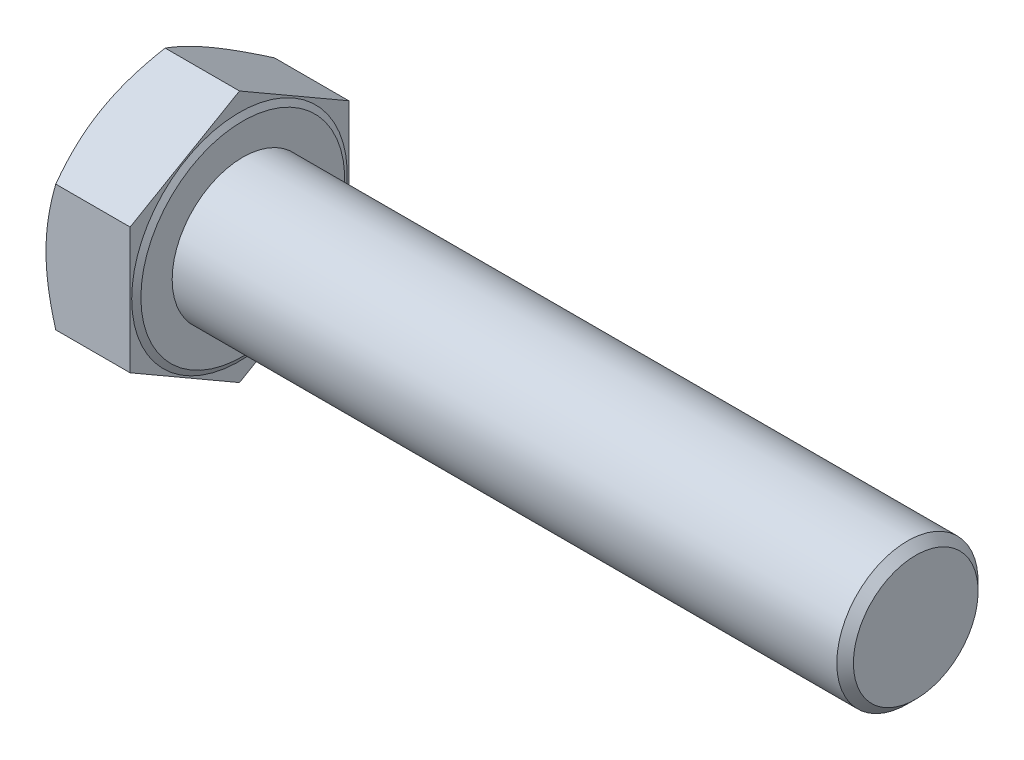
from build123d import *

# Parameters (mm, degrees)
BASEHEAD_DEPTH = 26


with BuildPart() as part:
    # HeadSke → BaseHead (new body)
    with BuildSketch(Plane(origin=(0, 0, 0), x_dir=(0, 0, -1), z_dir=(1, 0, 0))):
        Polygon((32.5, 18.763883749), (32.5, -18.763883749), (0, -37.527767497), (-32.5, -18.763883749), (-32.5, 18.763883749), (0, 37.527767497), align=None)
    extrude(amount=BASEHEAD_DEPTH)

    # BodySke → BaseBody (revolve)
    with BuildSketch(Plane.XY, mode=Mode.PRIVATE) as basebody_sk:
        Polygon((0, 0), (226, 0), (226, 18.533), (223.533, 21), (0, 21), align=None)
    revolve(basebody_sk.sketch.rotate(Axis((0, 0, 0), (1, 0, 0)), 90), axis=Axis((0, 0, 0), (1, 0, 0)))

    # Sketch3 → HeadChamfer (revolve, cut)
    with BuildSketch(Plane(origin=(0, 0, 0), x_dir=(1, 0, 0), z_dir=(0, 1, 0))):
        Polygon((-8.125, 18.427087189), (8.125, 46.572912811), (-13.525635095, 59.072912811), (-29.775635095, 30.927087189), align=None)
    revolve(axis=Axis((0, 0, 0), (1, 0, 0)), mode=Mode.SUBTRACT)

    # BearingSke → BearingFace (revolve, cut)
    with BuildSketch(Plane.XY, mode=Mode.PRIVATE) as bearingface_sk:
        Polygon((26, 30.3), (25, 32.032050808), (25, 37.527767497), (26, 37.527767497), align=None)
    revolve(bearingface_sk.sketch.rotate(Axis((0, 0, 0), (1, 0, 0)), 90), axis=Axis((0, 0, 0), (1, 0, 0)), mode=Mode.SUBTRACT)


solid = part.part
